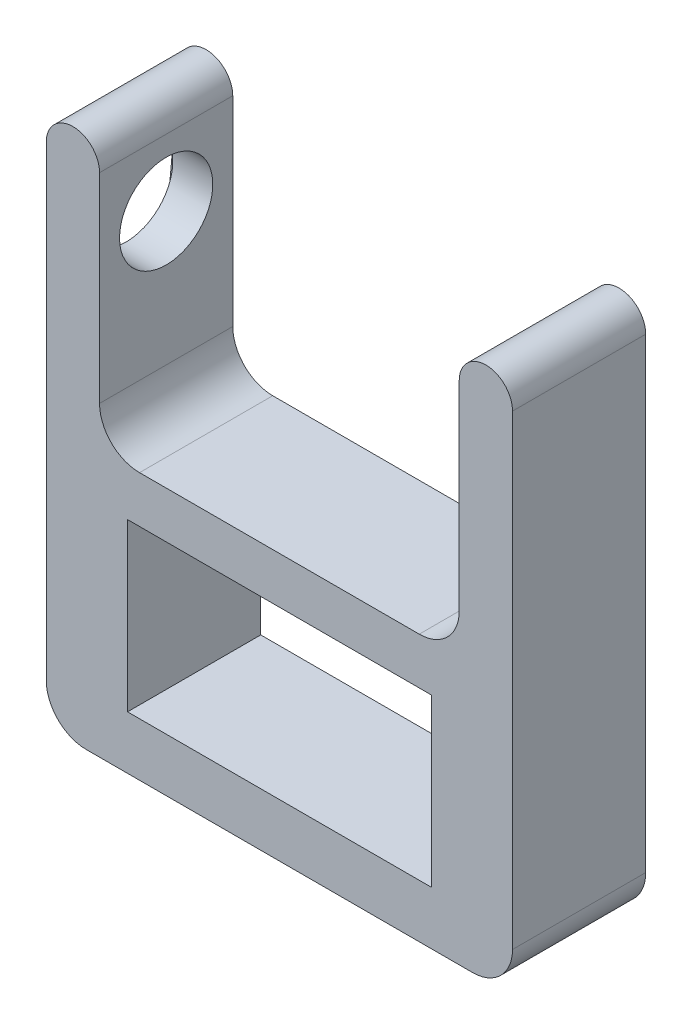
from build123d import *

# Parameters (mm, degrees)
SKETCH1_W           = 35
SKETCH1_H           = 40
BOSS_EXTRUDE1_DEPTH = 10
FILLET1_R           = 3
SKETCH2_W           = 27
SKETCH2_H           = 20
CUT_EXTRUDE1_DEPTH  = 29.394541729
FILLET2_RADIUS      = 2
FILLET2_LENGTH      = 10
FILLET3_RADIUS      = 2
FILLET3_LENGTH      = 10
SKETCH3_W           = 22.8
SKETCH3_H           = 12.5
CUT_EXTRUDE2_DEPTH  = 10
CUT_EXTRUDE3_REACH  = 43.533
SKETCH4_R           = 3.5
FILLET4_R           = 3
CUT_EXTRUDE4_DEPTH  = 1


with BuildPart() as part:
    # Sketch1 → Boss-Extrude1 (new body)
    with BuildSketch(Plane.XY):
        Rectangle(SKETCH1_W, SKETCH1_H)
    extrude(amount=BOSS_EXTRUDE1_DEPTH)

    # Fillet1
    fillet1_edges = [part.edges().sort_by_distance(p)[0] for p in [
        (17.5, -20, 5),
        (-17.5, -20, 5),
    ]]
    fillet(fillet1_edges, radius=FILLET1_R)

    # Sketch2 → Cut-Extrude1 (cut, through all)
    with BuildSketch(Plane.XY.offset(10)):
        with Locations((0, 10)):
            Rectangle(SKETCH2_W, SKETCH2_H)
    extrude(amount=-CUT_EXTRUDE1_DEPTH, mode=Mode.SUBTRACT)

    # Fillet2: full round fillet: the end face becomes a half cylinder, R = half its width
    fillet2_face = Plane((-15.5, 20, 5), x_dir=(0, 0, -1), z_dir=(0, 1, 0))  # on the end face: x along it, z out of the body
    fillet2_slab = fillet2_face.offset(-FILLET2_RADIUS / 2) * Box(FILLET2_LENGTH, 2 * FILLET2_RADIUS, FILLET2_RADIUS, mode=Mode.PRIVATE)  # the body's end, R deep
    fillet2_round = Plane((-15.5, 18, 5), x_dir=(0, 1, 0), z_dir=(0, 0, -1)) * Cylinder(FILLET2_RADIUS, FILLET2_LENGTH, mode=Mode.PRIVATE)  # its axis R under the face
    add(fillet2_slab - fillet2_round, mode=Mode.SUBTRACT)

    # Fillet3: full round fillet: the end face becomes a half cylinder, R = half its width
    fillet3_face = Plane((15.5, 20, 5), x_dir=(0, 0, 1), z_dir=(0, 1, 0))  # on the end face: x along it, z out of the body
    fillet3_slab = fillet3_face.offset(-FILLET3_RADIUS / 2) * Box(FILLET3_LENGTH, 2 * FILLET3_RADIUS, FILLET3_RADIUS, mode=Mode.PRIVATE)  # the body's end, R deep
    fillet3_round = Plane((15.5, 18, 5), x_dir=(0, 1, 0), z_dir=(0, 0, 1)) * Cylinder(FILLET3_RADIUS, FILLET3_LENGTH, mode=Mode.PRIVATE)  # its axis R under the face
    add(fillet3_slab - fillet3_round, mode=Mode.SUBTRACT)

    # Sketch3 → Cut-Extrude2 (cut)
    with BuildSketch(Plane.XY.offset(10)):
        with Locations((0, -9.75)):
            Rectangle(SKETCH3_W, SKETCH3_H)
    extrude(amount=-CUT_EXTRUDE2_DEPTH, mode=Mode.SUBTRACT)

    # Sketch4 → Cut-Extrude3 (cut, up to next)
    with BuildSketch(Plane.ZY.offset(17.5), mode=Mode.PRIVATE) as cut_extrude3_sk1:
        with Locations((5, 13)):
            Circle(SKETCH4_R)
    cut_extrude3_tool1 = extrude(cut_extrude3_sk1.sketch, amount=-CUT_EXTRUDE3_REACH, mode=Mode.PRIVATE) & part.part
    add(cut_extrude3_tool1.solids().sort_by_distance((-17.5, 13, 5))[0], mode=Mode.SUBTRACT)

    # Fillet4
    fillet4_edges = [part.edges().sort_by_distance(p)[0] for p in [
        (-13.5, 0, 5),
        (13.5, 0, 5),
    ]]
    fillet(fillet4_edges, radius=FILLET4_R)

    # Sketch5 → Cut-Extrude4 (cut)
    with BuildSketch(Plane.ZY.offset(17.5)):
        with BuildLine():
            Line((0.5, 13), (2, -2))
            ThreePointArc((2, -2), (5, -5), (8, -2))
            Line((8, -2), (9.5, 13))
            ThreePointArc((9.5, 13), (5, 17.5), (0.5, 13))
        make_face()
    extrude(amount=-CUT_EXTRUDE4_DEPTH, mode=Mode.SUBTRACT)


solid = part.part
